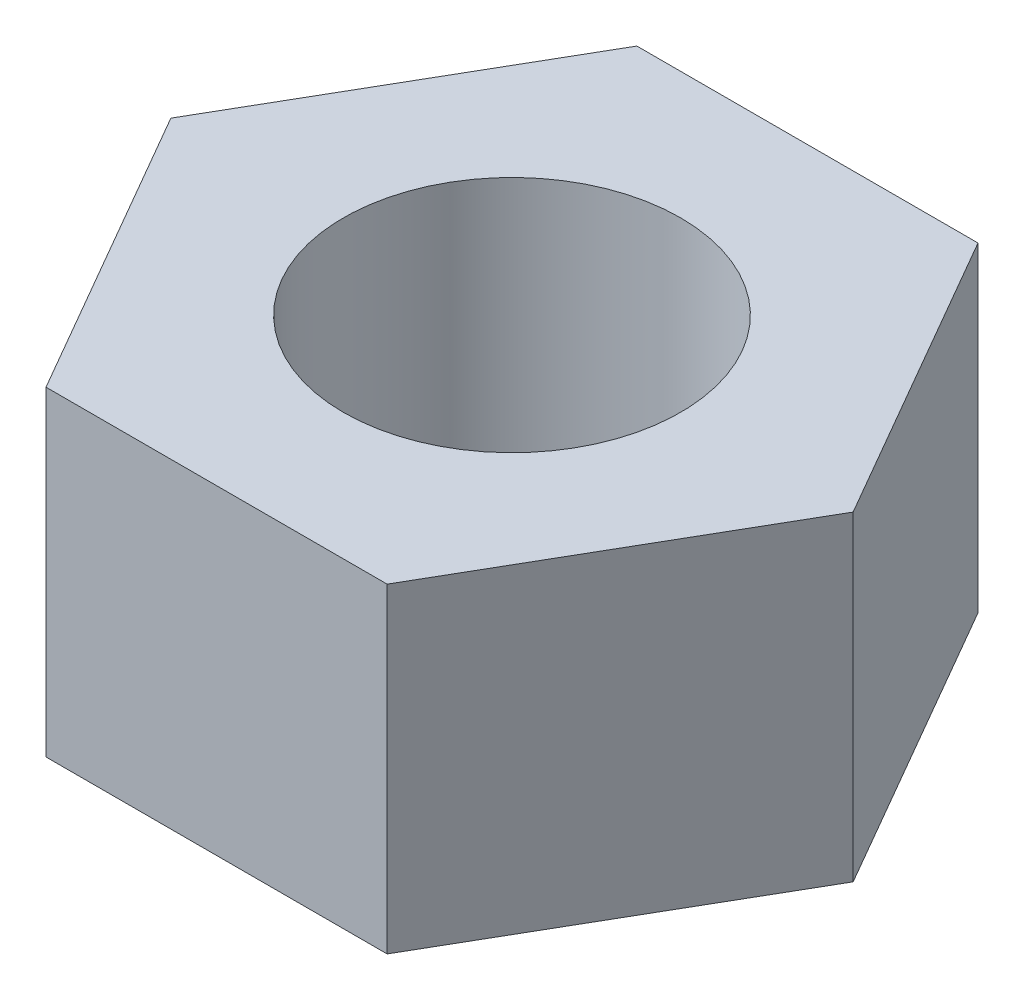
ISO-10303-21;
HEADER;
FILE_DESCRIPTION(('STEP AP214'),'2;1');
FILE_NAME('part.step','',(''),(''),'','','');
FILE_SCHEMA(('AUTOMOTIVE_DESIGN { 1 0 10303 214 1 1 1 1 }'));
ENDSEC;
DATA;
#1=APPLICATION_CONTEXT('core data for automotive mechanical design processes');
#2=APPLICATION_PROTOCOL_DEFINITION('international standard','automotive_design',2000,#1);
#3=PRODUCT_CONTEXT('',#1,'mechanical');
#4=PRODUCT('Part','Part','',(#3));
#5=PRODUCT_RELATED_PRODUCT_CATEGORY('part','',(#4));
#6=PRODUCT_DEFINITION_FORMATION('','',#4);
#7=PRODUCT_DEFINITION_CONTEXT('part definition',#1,'design');
#8=PRODUCT_DEFINITION('design','',#6,#7);
#9=PRODUCT_DEFINITION_SHAPE('','',#8);
#10=(LENGTH_UNIT() NAMED_UNIT(*) SI_UNIT(.MILLI.,.METRE.));
#11=(NAMED_UNIT(*) PLANE_ANGLE_UNIT() SI_UNIT($,.RADIAN.));
#12=(NAMED_UNIT(*) SI_UNIT($,.STERADIAN.) SOLID_ANGLE_UNIT());
#13=UNCERTAINTY_MEASURE_WITH_UNIT(LENGTH_MEASURE(1.E-05),#10,'distance_accuracy_value','');
#14=(GEOMETRIC_REPRESENTATION_CONTEXT(3) GLOBAL_UNCERTAINTY_ASSIGNED_CONTEXT((#13)) GLOBAL_UNIT_ASSIGNED_CONTEXT((#10,
#11,#12)) REPRESENTATION_CONTEXT('',''));
#15=CARTESIAN_POINT('',(0.,0.,0.));
#16=DIRECTION('',(0.,0.,1.));
#17=DIRECTION('',(1.,0.,0.));
#18=AXIS2_PLACEMENT_3D('',#15,#16,#17);
#19=CARTESIAN_POINT('',(0.,3.8,0.));
#20=DIRECTION('',(0.,1.,0.));
#21=DIRECTION('',(0.,0.,1.));
#22=AXIS2_PLACEMENT_3D('',#19,#20,#21);
#23=PLANE('',#22);
#24=DIRECTION('',(-1.,0.,0.));
#25=VECTOR('',#24,1.);
#26=CARTESIAN_POINT('',(2.02372816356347,3.8,-3.5052));
#27=LINE('',#26,#25);
#28=CARTESIAN_POINT('',(2.02372816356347,3.8,-3.5052));
#29=VERTEX_POINT('',#28);
#30=CARTESIAN_POINT('',(-2.02372816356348,3.8,-3.5052));
#31=VERTEX_POINT('',#30);
#32=EDGE_CURVE('E131',#29,#31,#27,.T.);
#33=ORIENTED_EDGE('',*,*,#32,.T.);
#34=DIRECTION('',(-0.5,0.,0.866025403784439));
#35=VECTOR('',#34,1.);
#36=CARTESIAN_POINT('',(-2.02372816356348,3.8,-3.5052));
#37=LINE('',#36,#35);
#38=CARTESIAN_POINT('',(-4.04745632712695,3.8,0.));
#39=VERTEX_POINT('',#38);
#40=EDGE_CURVE('E89',#31,#39,#37,.T.);
#41=ORIENTED_EDGE('',*,*,#40,.T.);
#42=DIRECTION('',(0.5,0.,0.866025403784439));
#43=VECTOR('',#42,1.);
#44=CARTESIAN_POINT('',(-4.04745632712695,3.8,0.));
#45=LINE('',#44,#43);
#46=CARTESIAN_POINT('',(-2.02372816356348,3.8,3.5052));
#47=VERTEX_POINT('',#46);
#48=EDGE_CURVE('E102',#39,#47,#45,.T.);
#49=ORIENTED_EDGE('',*,*,#48,.T.);
#50=DIRECTION('',(1.,0.,0.));
#51=VECTOR('',#50,1.);
#52=CARTESIAN_POINT('',(-2.02372816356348,3.8,3.5052));
#53=LINE('',#52,#51);
#54=CARTESIAN_POINT('',(2.02372816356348,3.8,3.5052));
#55=VERTEX_POINT('',#54);
#56=EDGE_CURVE('E96',#47,#55,#53,.T.);
#57=ORIENTED_EDGE('',*,*,#56,.T.);
#58=DIRECTION('',(0.5,0.,-0.866025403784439));
#59=VECTOR('',#58,1.);
#60=CARTESIAN_POINT('',(2.02372816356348,3.8,3.5052));
#61=LINE('',#60,#59);
#62=CARTESIAN_POINT('',(4.04745632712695,3.8,0.));
#63=VERTEX_POINT('',#62);
#64=EDGE_CURVE('E100',#55,#63,#61,.T.);
#65=ORIENTED_EDGE('',*,*,#64,.T.);
#66=DIRECTION('',(-0.5,0.,-0.866025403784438));
#67=VECTOR('',#66,1.);
#68=CARTESIAN_POINT('',(4.04745632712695,3.8,0.));
#69=LINE('',#68,#67);
#70=EDGE_CURVE('E52',#63,#29,#69,.T.);
#71=ORIENTED_EDGE('',*,*,#70,.T.);
#72=EDGE_LOOP('',(#33,#41,#49,#57,#65,#71));
#73=FACE_BOUND('',#72,.T.);
#74=CARTESIAN_POINT('',(0.,3.8,0.));
#75=DIRECTION('',(0.,1.,0.));
#76=DIRECTION('',(0.,0.,1.));
#77=AXIS2_PLACEMENT_3D('',#74,#75,#76);
#78=CIRCLE('',#77,2.);
#79=CARTESIAN_POINT('',(0.,3.8,-2.));
#80=VERTEX_POINT('',#79);
#81=EDGE_CURVE('E124',#80,#80,#78,.T.);
#82=ORIENTED_EDGE('',*,*,#81,.F.);
#83=EDGE_LOOP('',(#82));
#84=FACE_BOUND('',#83,.T.);
#85=ADVANCED_FACE('F35',(#73,#84),#23,.T.);
#86=CARTESIAN_POINT('',(0.,0.,0.));
#87=DIRECTION('',(0.,1.,0.));
#88=DIRECTION('',(0.,0.,1.));
#89=AXIS2_PLACEMENT_3D('',#86,#87,#88);
#90=PLANE('',#89);
#91=DIRECTION('',(-1.,0.,0.));
#92=VECTOR('',#91,1.);
#93=CARTESIAN_POINT('',(2.02372816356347,0.,-3.5052));
#94=LINE('',#93,#92);
#95=CARTESIAN_POINT('',(2.02372816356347,0.,-3.5052));
#96=VERTEX_POINT('',#95);
#97=CARTESIAN_POINT('',(-2.02372816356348,0.,-3.5052));
#98=VERTEX_POINT('',#97);
#99=EDGE_CURVE('E120',#96,#98,#94,.T.);
#100=ORIENTED_EDGE('',*,*,#99,.F.);
#101=DIRECTION('',(-0.5,0.,-0.866025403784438));
#102=VECTOR('',#101,1.);
#103=CARTESIAN_POINT('',(4.04745632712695,0.,0.));
#104=LINE('',#103,#102);
#105=CARTESIAN_POINT('',(4.04745632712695,0.,0.));
#106=VERTEX_POINT('',#105);
#107=EDGE_CURVE('E81',#106,#96,#104,.T.);
#108=ORIENTED_EDGE('',*,*,#107,.F.);
#109=DIRECTION('',(0.5,0.,-0.866025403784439));
#110=VECTOR('',#109,1.);
#111=CARTESIAN_POINT('',(2.02372816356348,0.,3.5052));
#112=LINE('',#111,#110);
#113=CARTESIAN_POINT('',(2.02372816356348,0.,3.5052));
#114=VERTEX_POINT('',#113);
#115=EDGE_CURVE('E75',#114,#106,#112,.T.);
#116=ORIENTED_EDGE('',*,*,#115,.F.);
#117=DIRECTION('',(1.,0.,0.));
#118=VECTOR('',#117,1.);
#119=CARTESIAN_POINT('',(-2.02372816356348,0.,3.5052));
#120=LINE('',#119,#118);
#121=CARTESIAN_POINT('',(-2.02372816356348,0.,3.5052));
#122=VERTEX_POINT('',#121);
#123=EDGE_CURVE('E110',#122,#114,#120,.T.);
#124=ORIENTED_EDGE('',*,*,#123,.F.);
#125=DIRECTION('',(0.5,0.,0.866025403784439));
#126=VECTOR('',#125,1.);
#127=CARTESIAN_POINT('',(-4.04745632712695,0.,0.));
#128=LINE('',#127,#126);
#129=CARTESIAN_POINT('',(-4.04745632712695,0.,0.));
#130=VERTEX_POINT('',#129);
#131=EDGE_CURVE('E126',#130,#122,#128,.T.);
#132=ORIENTED_EDGE('',*,*,#131,.F.);
#133=DIRECTION('',(-0.5,0.,0.866025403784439));
#134=VECTOR('',#133,1.);
#135=CARTESIAN_POINT('',(-2.02372816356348,0.,-3.5052));
#136=LINE('',#135,#134);
#137=EDGE_CURVE('E123',#98,#130,#136,.T.);
#138=ORIENTED_EDGE('',*,*,#137,.F.);
#139=EDGE_LOOP('',(#100,#108,#116,#124,#132,#138));
#140=FACE_BOUND('',#139,.T.);
#141=CARTESIAN_POINT('',(0.,0.,0.));
#142=DIRECTION('',(0.,1.,0.));
#143=DIRECTION('',(0.,0.,1.));
#144=AXIS2_PLACEMENT_3D('',#141,#142,#143);
#145=CIRCLE('',#144,2.);
#146=CARTESIAN_POINT('',(0.,0.,-2.));
#147=VERTEX_POINT('',#146);
#148=EDGE_CURVE('E224',#147,#147,#145,.T.);
#149=ORIENTED_EDGE('',*,*,#148,.T.);
#150=EDGE_LOOP('',(#149));
#151=FACE_BOUND('',#150,.T.);
#152=ADVANCED_FACE('F140',(#140,#151),#90,.F.);
#153=CARTESIAN_POINT('',(2.02372816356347,3.8,-3.5052));
#154=DIRECTION('',(0.,0.,1.));
#155=DIRECTION('',(1.,0.,0.));
#156=AXIS2_PLACEMENT_3D('',#153,#154,#155);
#157=PLANE('',#156);
#158=ORIENTED_EDGE('',*,*,#99,.T.);
#159=DIRECTION('',(0.,-1.,0.));
#160=VECTOR('',#159,1.);
#161=CARTESIAN_POINT('',(-2.02372816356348,3.8,-3.5052));
#162=LINE('',#161,#160);
#163=EDGE_CURVE('E11',#31,#98,#162,.T.);
#164=ORIENTED_EDGE('',*,*,#163,.F.);
#165=ORIENTED_EDGE('',*,*,#32,.F.);
#166=DIRECTION('',(0.,-1.,0.));
#167=VECTOR('',#166,1.);
#168=CARTESIAN_POINT('',(2.02372816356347,3.8,-3.5052));
#169=LINE('',#168,#167);
#170=EDGE_CURVE('E116',#29,#96,#169,.T.);
#171=ORIENTED_EDGE('',*,*,#170,.T.);
#172=EDGE_LOOP('',(#158,#164,#165,#171));
#173=FACE_BOUND('',#172,.T.);
#174=ADVANCED_FACE('F37',(#173),#157,.F.);
#175=CARTESIAN_POINT('',(-2.02372816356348,3.8,-3.5052));
#176=DIRECTION('',(0.866025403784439,0.,0.5));
#177=DIRECTION('',(0.5,0.,-0.866025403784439));
#178=AXIS2_PLACEMENT_3D('',#175,#176,#177);
#179=PLANE('',#178);
#180=ORIENTED_EDGE('',*,*,#137,.T.);
#181=DIRECTION('',(0.,-1.,0.));
#182=VECTOR('',#181,1.);
#183=CARTESIAN_POINT('',(-4.04745632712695,3.8,0.));
#184=LINE('',#183,#182);
#185=EDGE_CURVE('E44',#39,#130,#184,.T.);
#186=ORIENTED_EDGE('',*,*,#185,.F.);
#187=ORIENTED_EDGE('',*,*,#40,.F.);
#188=ORIENTED_EDGE('',*,*,#163,.T.);
#189=EDGE_LOOP('',(#180,#186,#187,#188));
#190=FACE_BOUND('',#189,.T.);
#191=ADVANCED_FACE('F165',(#190),#179,.F.);
#192=CARTESIAN_POINT('',(-4.04745632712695,3.8,0.));
#193=DIRECTION('',(0.866025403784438,0.,-0.5));
#194=DIRECTION('',(-0.5,0.,-0.866025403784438));
#195=AXIS2_PLACEMENT_3D('',#192,#193,#194);
#196=PLANE('',#195);
#197=ORIENTED_EDGE('',*,*,#131,.T.);
#198=DIRECTION('',(0.,-1.,0.));
#199=VECTOR('',#198,1.);
#200=CARTESIAN_POINT('',(-2.02372816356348,3.8,3.5052));
#201=LINE('',#200,#199);
#202=EDGE_CURVE('E111',#47,#122,#201,.T.);
#203=ORIENTED_EDGE('',*,*,#202,.F.);
#204=ORIENTED_EDGE('',*,*,#48,.F.);
#205=ORIENTED_EDGE('',*,*,#185,.T.);
#206=EDGE_LOOP('',(#197,#203,#204,#205));
#207=FACE_BOUND('',#206,.T.);
#208=ADVANCED_FACE('F137',(#207),#196,.F.);
#209=CARTESIAN_POINT('',(-2.02372816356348,3.8,3.5052));
#210=DIRECTION('',(0.,0.,-1.));
#211=DIRECTION('',(-1.,0.,0.));
#212=AXIS2_PLACEMENT_3D('',#209,#210,#211);
#213=PLANE('',#212);
#214=ORIENTED_EDGE('',*,*,#123,.T.);
#215=DIRECTION('',(0.,-1.,0.));
#216=VECTOR('',#215,1.);
#217=CARTESIAN_POINT('',(2.02372816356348,3.8,3.5052));
#218=LINE('',#217,#216);
#219=EDGE_CURVE('E107',#55,#114,#218,.T.);
#220=ORIENTED_EDGE('',*,*,#219,.F.);
#221=ORIENTED_EDGE('',*,*,#56,.F.);
#222=ORIENTED_EDGE('',*,*,#202,.T.);
#223=EDGE_LOOP('',(#214,#220,#221,#222));
#224=FACE_BOUND('',#223,.T.);
#225=ADVANCED_FACE('F108',(#224),#213,.F.);
#226=CARTESIAN_POINT('',(2.02372816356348,3.8,3.5052));
#227=DIRECTION('',(-0.866025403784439,0.,-0.5));
#228=DIRECTION('',(-0.5,0.,0.866025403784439));
#229=AXIS2_PLACEMENT_3D('',#226,#227,#228);
#230=PLANE('',#229);
#231=ORIENTED_EDGE('',*,*,#115,.T.);
#232=DIRECTION('',(0.,-1.,0.));
#233=VECTOR('',#232,1.);
#234=CARTESIAN_POINT('',(4.04745632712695,3.8,0.));
#235=LINE('',#234,#233);
#236=EDGE_CURVE('E112',#63,#106,#235,.T.);
#237=ORIENTED_EDGE('',*,*,#236,.F.);
#238=ORIENTED_EDGE('',*,*,#64,.F.);
#239=ORIENTED_EDGE('',*,*,#219,.T.);
#240=EDGE_LOOP('',(#231,#237,#238,#239));
#241=FACE_BOUND('',#240,.T.);
#242=ADVANCED_FACE('F114',(#241),#230,.F.);
#243=CARTESIAN_POINT('',(4.04745632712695,3.8,0.));
#244=DIRECTION('',(-0.866025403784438,0.,0.5));
#245=DIRECTION('',(0.5,0.,0.866025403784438));
#246=AXIS2_PLACEMENT_3D('',#243,#244,#245);
#247=PLANE('',#246);
#248=ORIENTED_EDGE('',*,*,#107,.T.);
#249=ORIENTED_EDGE('',*,*,#170,.F.);
#250=ORIENTED_EDGE('',*,*,#70,.F.);
#251=ORIENTED_EDGE('',*,*,#236,.T.);
#252=EDGE_LOOP('',(#248,#249,#250,#251));
#253=FACE_BOUND('',#252,.T.);
#254=ADVANCED_FACE('F145',(#253),#247,.F.);
#255=CARTESIAN_POINT('',(0.,3.8,0.));
#256=DIRECTION('',(0.,-1.,0.));
#257=DIRECTION('',(0.,0.,-1.));
#258=AXIS2_PLACEMENT_3D('',#255,#256,#257);
#259=CYLINDRICAL_SURFACE('',#258,2.);
#260=CARTESIAN_POINT('',(0.,3.8,-2.));
#261=CARTESIAN_POINT('',(0.,3.76041666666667,-2.));
#262=CARTESIAN_POINT('',(0.,3.72083333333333,-2.));
#263=CARTESIAN_POINT('',(0.,3.64166666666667,-2.));
#264=CARTESIAN_POINT('',(0.,3.60208333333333,-2.));
#265=CARTESIAN_POINT('',(0.,3.52291666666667,-2.));
#266=CARTESIAN_POINT('',(0.,3.48333333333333,-2.));
#267=CARTESIAN_POINT('',(0.,3.40416666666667,-2.));
#268=CARTESIAN_POINT('',(0.,3.36458333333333,-2.));
#269=CARTESIAN_POINT('',(0.,3.28541666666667,-2.));
#270=CARTESIAN_POINT('',(0.,3.24583333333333,-2.));
#271=CARTESIAN_POINT('',(0.,3.16666666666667,-2.));
#272=CARTESIAN_POINT('',(0.,3.12708333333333,-2.));
#273=CARTESIAN_POINT('',(0.,3.04791666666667,-2.));
#274=CARTESIAN_POINT('',(0.,3.00833333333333,-2.));
#275=CARTESIAN_POINT('',(0.,2.92916666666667,-2.));
#276=CARTESIAN_POINT('',(0.,2.88958333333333,-2.));
#277=CARTESIAN_POINT('',(0.,2.81041666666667,-2.));
#278=CARTESIAN_POINT('',(0.,2.77083333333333,-2.));
#279=CARTESIAN_POINT('',(0.,2.69166666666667,-2.));
#280=CARTESIAN_POINT('',(0.,2.65208333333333,-2.));
#281=CARTESIAN_POINT('',(0.,2.57291666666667,-2.));
#282=CARTESIAN_POINT('',(0.,2.53333333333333,-2.));
#283=CARTESIAN_POINT('',(0.,2.45416666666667,-2.));
#284=CARTESIAN_POINT('',(0.,2.41458333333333,-2.));
#285=CARTESIAN_POINT('',(0.,2.33541666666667,-2.));
#286=CARTESIAN_POINT('',(0.,2.29583333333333,-2.));
#287=CARTESIAN_POINT('',(0.,2.21666666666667,-2.));
#288=CARTESIAN_POINT('',(0.,2.17708333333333,-2.));
#289=CARTESIAN_POINT('',(0.,2.09791666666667,-2.));
#290=CARTESIAN_POINT('',(0.,2.05833333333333,-2.));
#291=CARTESIAN_POINT('',(0.,1.97916666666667,-2.));
#292=CARTESIAN_POINT('',(0.,1.93958333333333,-2.));
#293=CARTESIAN_POINT('',(0.,1.86041666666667,-2.));
#294=CARTESIAN_POINT('',(0.,1.82083333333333,-2.));
#295=CARTESIAN_POINT('',(0.,1.74166666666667,-2.));
#296=CARTESIAN_POINT('',(0.,1.70208333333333,-2.));
#297=CARTESIAN_POINT('',(0.,1.62291666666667,-2.));
#298=CARTESIAN_POINT('',(0.,1.58333333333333,-2.));
#299=CARTESIAN_POINT('',(0.,1.50416666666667,-2.));
#300=CARTESIAN_POINT('',(0.,1.46458333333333,-2.));
#301=CARTESIAN_POINT('',(0.,1.38541666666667,-2.));
#302=CARTESIAN_POINT('',(0.,1.34583333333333,-2.));
#303=CARTESIAN_POINT('',(0.,1.26666666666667,-2.));
#304=CARTESIAN_POINT('',(0.,1.22708333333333,-2.));
#305=CARTESIAN_POINT('',(0.,1.14791666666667,-2.));
#306=CARTESIAN_POINT('',(0.,1.10833333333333,-2.));
#307=CARTESIAN_POINT('',(0.,1.02916666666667,-2.));
#308=CARTESIAN_POINT('',(0.,0.989583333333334,-2.));
#309=CARTESIAN_POINT('',(0.,0.910416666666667,-2.));
#310=CARTESIAN_POINT('',(0.,0.870833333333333,-2.));
#311=CARTESIAN_POINT('',(0.,0.791666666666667,-2.));
#312=CARTESIAN_POINT('',(0.,0.752083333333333,-2.));
#313=CARTESIAN_POINT('',(0.,0.672916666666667,-2.));
#314=CARTESIAN_POINT('',(0.,0.633333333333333,-2.));
#315=CARTESIAN_POINT('',(0.,0.554166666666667,-2.));
#316=CARTESIAN_POINT('',(0.,0.514583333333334,-2.));
#317=CARTESIAN_POINT('',(0.,0.435416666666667,-2.));
#318=CARTESIAN_POINT('',(0.,0.395833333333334,-2.));
#319=CARTESIAN_POINT('',(0.,0.316666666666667,-2.));
#320=CARTESIAN_POINT('',(0.,0.277083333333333,-2.));
#321=CARTESIAN_POINT('',(0.,0.197916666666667,-2.));
#322=CARTESIAN_POINT('',(0.,0.158333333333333,-2.));
#323=CARTESIAN_POINT('',(0.,0.0791666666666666,-2.));
#324=CARTESIAN_POINT('',(0.,0.0395833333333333,-2.));
#325=CARTESIAN_POINT('',(0.,0.,-2.));
#326=B_SPLINE_CURVE_WITH_KNOTS('',3,(#260,#261,#262,#263,#264,#265,#266,#267,#268,#269,#270,
#271,#272,#273,#274,#275,#276,#277,#278,#279,#280,#281,#282,#283,#284,#285,#286,#287,#288,#289,
#290,#291,#292,#293,#294,#295,#296,#297,#298,#299,#300,#301,#302,#303,#304,#305,#306,#307,#308,
#309,#310,#311,#312,#313,#314,#315,#316,#317,#318,#319,#320,#321,#322,#323,#324,#325),
.UNSPECIFIED.,.F.,.F.,(4,2,2,2,2,2,2,2,2,2,2,2,2,2,2,2,2,2,2,2,2,2,2,2,2,2,2,2,2,2,2,2,4),(0.,
0.11875,0.2375,0.35625,0.475,0.59375,0.7125,0.83125,0.95,1.06875,1.1875,1.30625,1.425,1.54375,
1.6625,1.78125,1.9,2.01875,2.1375,2.25625,2.375,2.49375,2.6125,2.73125,2.85,2.96875,3.0875,
3.20625,3.325,3.44375,3.5625,3.68125,3.8),.UNSPECIFIED.);
#327=EDGE_CURVE('BSEAM147',#80,#147,#326,.T.);
#328=ORIENTED_EDGE('',*,*,#81,.T.);
#329=ORIENTED_EDGE('',*,*,#148,.F.);
#330=ORIENTED_EDGE('',*,*,#327,.T.);
#331=ORIENTED_EDGE('',*,*,#327,.F.);
#332=EDGE_LOOP('',(#328,#330,#329,#331));
#333=FACE_BOUND('',#332,.T.);
#334=ADVANCED_FACE('F147',(#333),#259,.F.);
#335=CLOSED_SHELL('',(#85,#152,#174,#191,#208,#225,#242,#254,#334));
#336=MANIFOLD_SOLID_BREP('B2',#335);
#337=ADVANCED_BREP_SHAPE_REPRESENTATION('',(#18,#336),#14);
#338=SHAPE_DEFINITION_REPRESENTATION(#9,#337);
ENDSEC;
END-ISO-10303-21;
